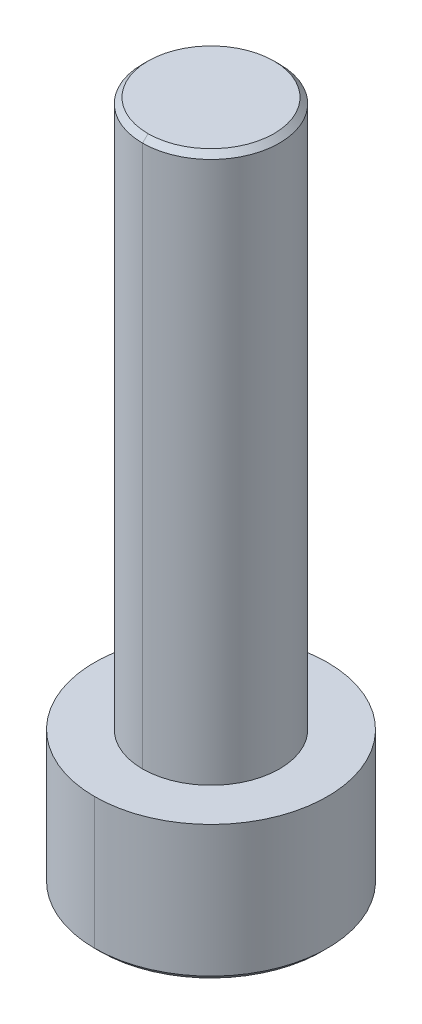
ISO-10303-21;
HEADER;
FILE_DESCRIPTION(('STEP AP214'),'2;1');
FILE_NAME('part.step','',(''),(''),'','','');
FILE_SCHEMA(('AUTOMOTIVE_DESIGN { 1 0 10303 214 1 1 1 1 }'));
ENDSEC;
DATA;
#1=APPLICATION_CONTEXT('core data for automotive mechanical design processes');
#2=APPLICATION_PROTOCOL_DEFINITION('international standard','automotive_design',2000,#1);
#3=PRODUCT_CONTEXT('',#1,'mechanical');
#4=PRODUCT('Part','Part','',(#3));
#5=PRODUCT_RELATED_PRODUCT_CATEGORY('part','',(#4));
#6=PRODUCT_DEFINITION_FORMATION('','',#4);
#7=PRODUCT_DEFINITION_CONTEXT('part definition',#1,'design');
#8=PRODUCT_DEFINITION('design','',#6,#7);
#9=PRODUCT_DEFINITION_SHAPE('','',#8);
#10=(LENGTH_UNIT() NAMED_UNIT(*) SI_UNIT(.MILLI.,.METRE.));
#11=(NAMED_UNIT(*) PLANE_ANGLE_UNIT() SI_UNIT($,.RADIAN.));
#12=(NAMED_UNIT(*) SI_UNIT($,.STERADIAN.) SOLID_ANGLE_UNIT());
#13=UNCERTAINTY_MEASURE_WITH_UNIT(LENGTH_MEASURE(1.E-05),#10,'distance_accuracy_value','');
#14=(GEOMETRIC_REPRESENTATION_CONTEXT(3) GLOBAL_UNCERTAINTY_ASSIGNED_CONTEXT((#13)) GLOBAL_UNIT_ASSIGNED_CONTEXT((#10,
#11,#12)) REPRESENTATION_CONTEXT('',''));
#15=CARTESIAN_POINT('',(0.,0.,0.));
#16=DIRECTION('',(0.,0.,1.));
#17=DIRECTION('',(1.,0.,0.));
#18=AXIS2_PLACEMENT_3D('',#15,#16,#17);
#19=CARTESIAN_POINT('',(-17.32050807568,-90.8165,-10.));
#20=DIRECTION('',(0.,-1.,0.));
#21=DIRECTION('',(-1.,0.,0.));
#22=AXIS2_PLACEMENT_3D('',#19,#20,#21);
#23=PLANE('',#22);
#24=DIRECTION('',(-0.50000000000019,0.,-0.866025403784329));
#25=VECTOR('',#24,1.);
#26=CARTESIAN_POINT('',(-16.16580753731,-90.8165,-12.));
#27=LINE('',#26,#25);
#28=CARTESIAN_POINT('',(-15.01110699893,-90.8165,-10.));
#29=VERTEX_POINT('',#28);
#30=CARTESIAN_POINT('',(-16.16580753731,-90.8165,-12.));
#31=VERTEX_POINT('',#30);
#32=EDGE_CURVE('E198',#29,#31,#27,.T.);
#33=ORIENTED_EDGE('',*,*,#32,.F.);
#34=DIRECTION('',(0.50000000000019,0.,-0.866025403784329));
#35=VECTOR('',#34,1.);
#36=CARTESIAN_POINT('',(-15.01110699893,-90.8165,-10.));
#37=LINE('',#36,#35);
#38=CARTESIAN_POINT('',(-16.16580753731,-90.8165,-8.));
#39=VERTEX_POINT('',#38);
#40=EDGE_CURVE('E10',#39,#29,#37,.T.);
#41=ORIENTED_EDGE('',*,*,#40,.F.);
#42=DIRECTION('',(1.,0.,0.));
#43=VECTOR('',#42,1.);
#44=CARTESIAN_POINT('',(-16.16580753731,-90.8165,-8.));
#45=LINE('',#44,#43);
#46=CARTESIAN_POINT('',(-18.47520861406,-90.8165,-8.));
#47=VERTEX_POINT('',#46);
#48=EDGE_CURVE('E46',#47,#39,#45,.T.);
#49=ORIENTED_EDGE('',*,*,#48,.F.);
#50=DIRECTION('',(0.50000000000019,0.,0.866025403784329));
#51=VECTOR('',#50,1.);
#52=CARTESIAN_POINT('',(-18.47520861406,-90.8165,-8.));
#53=LINE('',#52,#51);
#54=CARTESIAN_POINT('',(-19.62990915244,-90.8165,-10.));
#55=VERTEX_POINT('',#54);
#56=EDGE_CURVE('E192',#55,#47,#53,.T.);
#57=ORIENTED_EDGE('',*,*,#56,.F.);
#58=DIRECTION('',(-0.50000000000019,0.,0.866025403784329));
#59=VECTOR('',#58,1.);
#60=CARTESIAN_POINT('',(-19.62990915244,-90.8165,-10.));
#61=LINE('',#60,#59);
#62=CARTESIAN_POINT('',(-18.47520861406,-90.8165,-12.));
#63=VERTEX_POINT('',#62);
#64=EDGE_CURVE('E179',#63,#55,#61,.T.);
#65=ORIENTED_EDGE('',*,*,#64,.F.);
#66=DIRECTION('',(-1.,0.,0.));
#67=VECTOR('',#66,1.);
#68=CARTESIAN_POINT('',(-18.47520861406,-90.8165,-12.));
#69=LINE('',#68,#67);
#70=EDGE_CURVE('E20',#31,#63,#69,.T.);
#71=ORIENTED_EDGE('',*,*,#70,.F.);
#72=EDGE_LOOP('',(#33,#41,#49,#57,#65,#71));
#73=FACE_BOUND('',#72,.T.);
#74=ADVANCED_FACE('F16',(#73),#23,.T.);
#75=CARTESIAN_POINT('',(-15.01110699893,-90.8165,-10.));
#76=DIRECTION('',(-0.866025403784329,0.,-0.50000000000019));
#77=DIRECTION('',(-0.50000000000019,0.,0.866025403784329));
#78=AXIS2_PLACEMENT_3D('',#75,#76,#77);
#79=PLANE('',#78);
#80=DIRECTION('',(0.50000000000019,0.,-0.866025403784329));
#81=VECTOR('',#80,1.);
#82=CARTESIAN_POINT('',(-15.01110699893,-93.3165,-10.));
#83=LINE('',#82,#81);
#84=CARTESIAN_POINT('',(-16.16580753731,-93.3165,-8.));
#85=VERTEX_POINT('',#84);
#86=CARTESIAN_POINT('',(-15.01110699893,-93.3165,-10.));
#87=VERTEX_POINT('',#86);
#88=EDGE_CURVE('E215',#85,#87,#83,.T.);
#89=ORIENTED_EDGE('',*,*,#88,.F.);
#90=DIRECTION('',(0.,-1.,0.));
#91=VECTOR('',#90,1.);
#92=CARTESIAN_POINT('',(-16.16580753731,-90.8165,-8.));
#93=LINE('',#92,#91);
#94=EDGE_CURVE('E26',#39,#85,#93,.T.);
#95=ORIENTED_EDGE('',*,*,#94,.F.);
#96=ORIENTED_EDGE('',*,*,#40,.T.);
#97=DIRECTION('',(0.,-1.,0.));
#98=VECTOR('',#97,1.);
#99=CARTESIAN_POINT('',(-15.01110699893,-90.8165,-10.));
#100=LINE('',#99,#98);
#101=EDGE_CURVE('E154',#29,#87,#100,.T.);
#102=ORIENTED_EDGE('',*,*,#101,.T.);
#103=EDGE_LOOP('',(#89,#95,#96,#102));
#104=FACE_BOUND('',#103,.T.);
#105=ADVANCED_FACE('F342',(#104),#79,.T.);
#106=CARTESIAN_POINT('',(-16.16580753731,-90.8165,-8.));
#107=DIRECTION('',(0.,0.,-1.));
#108=DIRECTION('',(-1.,0.,0.));
#109=AXIS2_PLACEMENT_3D('',#106,#107,#108);
#110=PLANE('',#109);
#111=DIRECTION('',(1.,0.,0.));
#112=VECTOR('',#111,1.);
#113=CARTESIAN_POINT('',(-16.16580753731,-93.3165,-8.));
#114=LINE('',#113,#112);
#115=CARTESIAN_POINT('',(-18.47520861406,-93.3165,-8.));
#116=VERTEX_POINT('',#115);
#117=EDGE_CURVE('E237',#116,#85,#114,.T.);
#118=ORIENTED_EDGE('',*,*,#117,.F.);
#119=DIRECTION('',(0.,-1.,0.));
#120=VECTOR('',#119,1.);
#121=CARTESIAN_POINT('',(-18.47520861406,-90.8165,-8.));
#122=LINE('',#121,#120);
#123=EDGE_CURVE('E196',#47,#116,#122,.T.);
#124=ORIENTED_EDGE('',*,*,#123,.F.);
#125=ORIENTED_EDGE('',*,*,#48,.T.);
#126=ORIENTED_EDGE('',*,*,#94,.T.);
#127=EDGE_LOOP('',(#118,#124,#125,#126));
#128=FACE_BOUND('',#127,.T.);
#129=ADVANCED_FACE('F292',(#128),#110,.T.);
#130=CARTESIAN_POINT('',(-18.47520861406,-90.8165,-8.));
#131=DIRECTION('',(0.866025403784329,0.,-0.50000000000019));
#132=DIRECTION('',(0.,-1.,0.));
#133=AXIS2_PLACEMENT_3D('',#130,#131,#132);
#134=PLANE('',#133);
#135=DIRECTION('',(0.50000000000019,0.,0.866025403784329));
#136=VECTOR('',#135,1.);
#137=CARTESIAN_POINT('',(-18.47520861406,-93.3165,-8.));
#138=LINE('',#137,#136);
#139=CARTESIAN_POINT('',(-19.62990915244,-93.3165,-10.));
#140=VERTEX_POINT('',#139);
#141=EDGE_CURVE('E190',#140,#116,#138,.T.);
#142=ORIENTED_EDGE('',*,*,#141,.F.);
#143=DIRECTION('',(0.,-1.,0.));
#144=VECTOR('',#143,1.);
#145=CARTESIAN_POINT('',(-19.62990915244,-90.8165,-10.));
#146=LINE('',#145,#144);
#147=EDGE_CURVE('E197',#55,#140,#146,.T.);
#148=ORIENTED_EDGE('',*,*,#147,.F.);
#149=ORIENTED_EDGE('',*,*,#56,.T.);
#150=ORIENTED_EDGE('',*,*,#123,.T.);
#151=EDGE_LOOP('',(#142,#148,#149,#150));
#152=FACE_BOUND('',#151,.T.);
#153=ADVANCED_FACE('F296',(#152),#134,.T.);
#154=CARTESIAN_POINT('',(-19.62990915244,-90.8165,-10.));
#155=DIRECTION('',(0.866025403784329,0.,0.50000000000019));
#156=DIRECTION('',(0.,-1.,0.));
#157=AXIS2_PLACEMENT_3D('',#154,#155,#156);
#158=PLANE('',#157);
#159=DIRECTION('',(-0.50000000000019,0.,0.866025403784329));
#160=VECTOR('',#159,1.);
#161=CARTESIAN_POINT('',(-19.62990915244,-93.3165,-10.));
#162=LINE('',#161,#160);
#163=CARTESIAN_POINT('',(-18.47520861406,-93.3165,-12.));
#164=VERTEX_POINT('',#163);
#165=EDGE_CURVE('E186',#164,#140,#162,.T.);
#166=ORIENTED_EDGE('',*,*,#165,.F.);
#167=DIRECTION('',(0.,-1.,0.));
#168=VECTOR('',#167,1.);
#169=CARTESIAN_POINT('',(-18.47520861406,-90.8165,-12.));
#170=LINE('',#169,#168);
#171=EDGE_CURVE('E177',#63,#164,#170,.T.);
#172=ORIENTED_EDGE('',*,*,#171,.F.);
#173=ORIENTED_EDGE('',*,*,#64,.T.);
#174=ORIENTED_EDGE('',*,*,#147,.T.);
#175=EDGE_LOOP('',(#166,#172,#173,#174));
#176=FACE_BOUND('',#175,.T.);
#177=ADVANCED_FACE('F18',(#176),#158,.T.);
#178=CARTESIAN_POINT('',(-18.47520861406,-90.8165,-12.));
#179=DIRECTION('',(0.,0.,1.));
#180=DIRECTION('',(1.,0.,0.));
#181=AXIS2_PLACEMENT_3D('',#178,#179,#180);
#182=PLANE('',#181);
#183=DIRECTION('',(-1.,0.,0.));
#184=VECTOR('',#183,1.);
#185=CARTESIAN_POINT('',(-18.47520861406,-93.3165,-12.));
#186=LINE('',#185,#184);
#187=CARTESIAN_POINT('',(-16.16580753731,-93.3165,-12.));
#188=VERTEX_POINT('',#187);
#189=EDGE_CURVE('E191',#188,#164,#186,.T.);
#190=ORIENTED_EDGE('',*,*,#189,.F.);
#191=DIRECTION('',(0.,-1.,0.));
#192=VECTOR('',#191,1.);
#193=CARTESIAN_POINT('',(-16.16580753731,-90.8165,-12.));
#194=LINE('',#193,#192);
#195=EDGE_CURVE('E201',#31,#188,#194,.T.);
#196=ORIENTED_EDGE('',*,*,#195,.F.);
#197=ORIENTED_EDGE('',*,*,#70,.T.);
#198=ORIENTED_EDGE('',*,*,#171,.T.);
#199=EDGE_LOOP('',(#190,#196,#197,#198));
#200=FACE_BOUND('',#199,.T.);
#201=ADVANCED_FACE('F301',(#200),#182,.T.);
#202=CARTESIAN_POINT('',(-16.16580753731,-90.8165,-12.));
#203=DIRECTION('',(-0.866025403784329,0.,0.50000000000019));
#204=DIRECTION('',(0.,1.,0.));
#205=AXIS2_PLACEMENT_3D('',#202,#203,#204);
#206=PLANE('',#205);
#207=DIRECTION('',(-0.50000000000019,0.,-0.866025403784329));
#208=VECTOR('',#207,1.);
#209=CARTESIAN_POINT('',(-16.16580753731,-93.3165,-12.));
#210=LINE('',#209,#208);
#211=EDGE_CURVE('E233',#87,#188,#210,.T.);
#212=ORIENTED_EDGE('',*,*,#211,.F.);
#213=ORIENTED_EDGE('',*,*,#101,.F.);
#214=ORIENTED_EDGE('',*,*,#32,.T.);
#215=ORIENTED_EDGE('',*,*,#195,.T.);
#216=EDGE_LOOP('',(#212,#213,#214,#215));
#217=FACE_BOUND('',#216,.T.);
#218=ADVANCED_FACE('F357',(#217),#206,.T.);
#219=CARTESIAN_POINT('',(-15.02050807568,-68.3165,-10.));
#220=DIRECTION('',(0.,1.,0.));
#221=DIRECTION('',(0.,0.,-1.));
#222=AXIS2_PLACEMENT_3D('',#219,#220,#221);
#223=PLANE('',#222);
#224=CARTESIAN_POINT('',(-17.32050807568,-68.3165,-10.));
#225=DIRECTION('',(0.,-1.,0.));
#226=DIRECTION('',(0.,0.,-1.));
#227=AXIS2_PLACEMENT_3D('',#224,#225,#226);
#228=CIRCLE('',#227,2.3);
#229=CARTESIAN_POINT('',(-17.32050807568,-68.3165,-12.3));
#230=VERTEX_POINT('',#229);
#231=CARTESIAN_POINT('',(-17.32050807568,-68.3165,-7.7));
#232=VERTEX_POINT('',#231);
#233=EDGE_CURVE('E149',#230,#232,#228,.T.);
#234=ORIENTED_EDGE('',*,*,#233,.F.);
#235=CARTESIAN_POINT('',(-17.32050807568,-68.3165,-10.));
#236=DIRECTION('',(0.,-1.,0.));
#237=DIRECTION('',(0.,0.,-1.));
#238=AXIS2_PLACEMENT_3D('',#235,#236,#237);
#239=CIRCLE('',#238,2.3);
#240=EDGE_CURVE('E145',#232,#230,#239,.T.);
#241=ORIENTED_EDGE('',*,*,#240,.F.);
#242=EDGE_LOOP('',(#234,#241));
#243=FACE_BOUND('',#242,.T.);
#244=ADVANCED_FACE('F147',(#243),#223,.T.);
#245=CARTESIAN_POINT('',(-17.32050807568,-68.5165,-10.));
#246=DIRECTION('',(0.,-1.,0.));
#247=DIRECTION('',(0.,0.,-1.));
#248=AXIS2_PLACEMENT_3D('',#245,#246,#247);
#249=CONICAL_SURFACE('',#248,2.5,0.785398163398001);
#250=DIRECTION('',(0.,-0.707106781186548,0.707106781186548));
#251=VECTOR('',#250,1.);
#252=CARTESIAN_POINT('',(-17.32050807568,-68.5165,-7.5));
#253=LINE('',#252,#251);
#254=CARTESIAN_POINT('',(-17.32050807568,-68.5165,-7.5));
#255=VERTEX_POINT('',#254);
#256=EDGE_CURVE('E158',#232,#255,#253,.T.);
#257=ORIENTED_EDGE('',*,*,#256,.F.);
#258=ORIENTED_EDGE('',*,*,#240,.T.);
#259=DIRECTION('',(0.,-0.707106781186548,-0.707106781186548));
#260=VECTOR('',#259,1.);
#261=CARTESIAN_POINT('',(-17.32050807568,-68.5165,-12.5));
#262=LINE('',#261,#260);
#263=CARTESIAN_POINT('',(-17.32050807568,-68.5165,-12.5));
#264=VERTEX_POINT('',#263);
#265=EDGE_CURVE('E167',#230,#264,#262,.T.);
#266=ORIENTED_EDGE('',*,*,#265,.T.);
#267=CARTESIAN_POINT('',(-17.32050807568,-68.5165,-10.));
#268=DIRECTION('',(0.,-1.,0.));
#269=DIRECTION('',(0.,0.,-1.));
#270=AXIS2_PLACEMENT_3D('',#267,#268,#269);
#271=CIRCLE('',#270,2.5);
#272=EDGE_CURVE('E155',#255,#264,#271,.T.);
#273=ORIENTED_EDGE('',*,*,#272,.F.);
#274=EDGE_LOOP('',(#257,#258,#266,#273));
#275=FACE_BOUND('',#274,.T.);
#276=ADVANCED_FACE('F159',(#275),#249,.T.);
#277=CARTESIAN_POINT('',(-17.32050807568,-588.3165,-10.));
#278=DIRECTION('',(0.,-1.,0.));
#279=DIRECTION('',(0.,0.,-1.));
#280=AXIS2_PLACEMENT_3D('',#277,#278,#279);
#281=CYLINDRICAL_SURFACE('',#280,2.5);
#282=DIRECTION('',(0.,-1.,0.));
#283=VECTOR('',#282,1.);
#284=CARTESIAN_POINT('',(-17.32050807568,-588.3165,-7.5));
#285=LINE('',#284,#283);
#286=CARTESIAN_POINT('',(-17.32050807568,-88.3165,-7.5));
#287=VERTEX_POINT('',#286);
#288=EDGE_CURVE('E220',#255,#287,#285,.T.);
#289=ORIENTED_EDGE('',*,*,#288,.F.);
#290=ORIENTED_EDGE('',*,*,#272,.T.);
#291=DIRECTION('',(0.,-1.,0.));
#292=VECTOR('',#291,1.);
#293=CARTESIAN_POINT('',(-17.32050807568,-588.3165,-12.5));
#294=LINE('',#293,#292);
#295=CARTESIAN_POINT('',(-17.32050807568,-88.3165,-12.5));
#296=VERTEX_POINT('',#295);
#297=EDGE_CURVE('E208',#264,#296,#294,.T.);
#298=ORIENTED_EDGE('',*,*,#297,.T.);
#299=CARTESIAN_POINT('',(-17.32050807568,-88.3165,-10.));
#300=DIRECTION('',(0.,-1.,0.));
#301=DIRECTION('',(0.,0.,-1.));
#302=AXIS2_PLACEMENT_3D('',#299,#300,#301);
#303=CIRCLE('',#302,2.5);
#304=EDGE_CURVE('E240',#287,#296,#303,.T.);
#305=ORIENTED_EDGE('',*,*,#304,.F.);
#306=EDGE_LOOP('',(#289,#290,#298,#305));
#307=FACE_BOUND('',#306,.T.);
#308=ADVANCED_FACE('F325',(#307),#281,.T.);
#309=CARTESIAN_POINT('',(-13.07050807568,-88.3165,-10.));
#310=DIRECTION('',(0.,1.,0.));
#311=DIRECTION('',(0.,0.,-1.));
#312=AXIS2_PLACEMENT_3D('',#309,#310,#311);
#313=PLANE('',#312);
#314=CARTESIAN_POINT('',(-17.32050807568,-88.3165,-10.));
#315=DIRECTION('',(0.,-1.,0.));
#316=DIRECTION('',(0.,0.,-1.));
#317=AXIS2_PLACEMENT_3D('',#314,#315,#316);
#318=CIRCLE('',#317,4.25);
#319=CARTESIAN_POINT('',(-17.32050807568,-88.3165,-14.25));
#320=VERTEX_POINT('',#319);
#321=CARTESIAN_POINT('',(-17.32050807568,-88.3165,-5.75));
#322=VERTEX_POINT('',#321);
#323=EDGE_CURVE('E203',#320,#322,#318,.T.);
#324=ORIENTED_EDGE('',*,*,#323,.F.);
#325=CARTESIAN_POINT('',(-17.32050807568,-88.3165,-10.));
#326=DIRECTION('',(0.,-1.,0.));
#327=DIRECTION('',(0.,0.,-1.));
#328=AXIS2_PLACEMENT_3D('',#325,#326,#327);
#329=CIRCLE('',#328,4.25);
#330=EDGE_CURVE('E264',#322,#320,#329,.T.);
#331=ORIENTED_EDGE('',*,*,#330,.F.);
#332=EDGE_LOOP('',(#324,#331));
#333=FACE_BOUND('',#332,.T.);
#334=CARTESIAN_POINT('',(-17.32050807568,-88.3165,-10.));
#335=DIRECTION('',(0.,-1.,0.));
#336=DIRECTION('',(0.,0.,-1.));
#337=AXIS2_PLACEMENT_3D('',#334,#335,#336);
#338=CIRCLE('',#337,2.5);
#339=EDGE_CURVE('E175',#296,#287,#338,.T.);
#340=ORIENTED_EDGE('',*,*,#339,.T.);
#341=ORIENTED_EDGE('',*,*,#304,.T.);
#342=EDGE_LOOP('',(#340,#341));
#343=FACE_BOUND('',#342,.T.);
#344=ADVANCED_FACE('F312',(#333,#343),#313,.T.);
#345=CARTESIAN_POINT('',(-17.32050807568,-588.3165,-10.));
#346=DIRECTION('',(0.,-1.,0.));
#347=DIRECTION('',(0.,0.,-1.));
#348=AXIS2_PLACEMENT_3D('',#345,#346,#347);
#349=CYLINDRICAL_SURFACE('',#348,4.25);
#350=DIRECTION('',(0.,-1.,0.));
#351=VECTOR('',#350,1.);
#352=CARTESIAN_POINT('',(-17.32050807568,-588.3165,-5.75));
#353=LINE('',#352,#351);
#354=CARTESIAN_POINT('',(-17.32050807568,-93.1165,-5.75));
#355=VERTEX_POINT('',#354);
#356=EDGE_CURVE('E207',#322,#355,#353,.T.);
#357=ORIENTED_EDGE('',*,*,#356,.F.);
#358=ORIENTED_EDGE('',*,*,#330,.T.);
#359=DIRECTION('',(0.,-1.,0.));
#360=VECTOR('',#359,1.);
#361=CARTESIAN_POINT('',(-17.32050807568,-588.3165,-14.25));
#362=LINE('',#361,#360);
#363=CARTESIAN_POINT('',(-17.32050807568,-93.1165,-14.25));
#364=VERTEX_POINT('',#363);
#365=EDGE_CURVE('E180',#320,#364,#362,.T.);
#366=ORIENTED_EDGE('',*,*,#365,.T.);
#367=CARTESIAN_POINT('',(-17.32050807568,-93.1165,-10.));
#368=DIRECTION('',(0.,-1.,0.));
#369=DIRECTION('',(0.,0.,-1.));
#370=AXIS2_PLACEMENT_3D('',#367,#368,#369);
#371=CIRCLE('',#370,4.25);
#372=EDGE_CURVE('E262',#355,#364,#371,.T.);
#373=ORIENTED_EDGE('',*,*,#372,.F.);
#374=EDGE_LOOP('',(#357,#358,#366,#373));
#375=FACE_BOUND('',#374,.T.);
#376=ADVANCED_FACE('F306',(#375),#349,.T.);
#377=CARTESIAN_POINT('',(-17.32050807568,-93.3165,-10.));
#378=DIRECTION('',(0.,1.,0.));
#379=DIRECTION('',(0.,0.,1.));
#380=AXIS2_PLACEMENT_3D('',#377,#378,#379);
#381=CONICAL_SURFACE('',#380,4.05,0.785398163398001);
#382=DIRECTION('',(0.,0.707106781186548,-0.707106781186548));
#383=VECTOR('',#382,1.);
#384=CARTESIAN_POINT('',(-17.32050807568,-93.3165,-14.05));
#385=LINE('',#384,#383);
#386=CARTESIAN_POINT('',(-17.32050807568,-93.3165,-14.05));
#387=VERTEX_POINT('',#386);
#388=EDGE_CURVE('E226',#387,#364,#385,.T.);
#389=ORIENTED_EDGE('',*,*,#388,.F.);
#390=CARTESIAN_POINT('',(-17.32050807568,-93.3165,-10.));
#391=DIRECTION('',(0.,-1.,0.));
#392=DIRECTION('',(0.,0.,-1.));
#393=AXIS2_PLACEMENT_3D('',#390,#391,#392);
#394=CIRCLE('',#393,4.05);
#395=CARTESIAN_POINT('',(-17.32050807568,-93.3165,-5.95));
#396=VERTEX_POINT('',#395);
#397=EDGE_CURVE('E62',#396,#387,#394,.T.);
#398=ORIENTED_EDGE('',*,*,#397,.F.);
#399=DIRECTION('',(0.,0.707106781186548,0.707106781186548));
#400=VECTOR('',#399,1.);
#401=CARTESIAN_POINT('',(-17.32050807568,-93.3165,-5.95));
#402=LINE('',#401,#400);
#403=EDGE_CURVE('E216',#396,#355,#402,.T.);
#404=ORIENTED_EDGE('',*,*,#403,.T.);
#405=ORIENTED_EDGE('',*,*,#372,.T.);
#406=EDGE_LOOP('',(#389,#398,#404,#405));
#407=FACE_BOUND('',#406,.T.);
#408=ADVANCED_FACE('F311',(#407),#381,.T.);
#409=CARTESIAN_POINT('',(-17.32050807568,-93.3165,-10.));
#410=DIRECTION('',(0.,-1.,0.));
#411=DIRECTION('',(-1.,0.,0.));
#412=AXIS2_PLACEMENT_3D('',#409,#410,#411);
#413=PLANE('',#412);
#414=ORIENTED_EDGE('',*,*,#88,.T.);
#415=ORIENTED_EDGE('',*,*,#211,.T.);
#416=ORIENTED_EDGE('',*,*,#189,.T.);
#417=ORIENTED_EDGE('',*,*,#165,.T.);
#418=ORIENTED_EDGE('',*,*,#141,.T.);
#419=ORIENTED_EDGE('',*,*,#117,.T.);
#420=EDGE_LOOP('',(#414,#415,#416,#417,#418,#419));
#421=FACE_BOUND('',#420,.T.);
#422=ORIENTED_EDGE('',*,*,#397,.T.);
#423=CARTESIAN_POINT('',(-17.32050807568,-93.3165,-10.));
#424=DIRECTION('',(0.,-1.,0.));
#425=DIRECTION('',(0.,0.,-1.));
#426=AXIS2_PLACEMENT_3D('',#423,#424,#425);
#427=CIRCLE('',#426,4.05);
#428=EDGE_CURVE('E184',#387,#396,#427,.T.);
#429=ORIENTED_EDGE('',*,*,#428,.T.);
#430=EDGE_LOOP('',(#422,#429));
#431=FACE_BOUND('',#430,.T.);
#432=ADVANCED_FACE('F410',(#421,#431),#413,.T.);
#433=CARTESIAN_POINT('',(-17.32050807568,-93.3165,-10.));
#434=DIRECTION('',(0.,1.,0.));
#435=DIRECTION('',(0.,0.,1.));
#436=AXIS2_PLACEMENT_3D('',#433,#434,#435);
#437=CONICAL_SURFACE('',#436,4.05,0.785398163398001);
#438=ORIENTED_EDGE('',*,*,#428,.F.);
#439=ORIENTED_EDGE('',*,*,#388,.T.);
#440=CARTESIAN_POINT('',(-17.32050807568,-93.1165,-10.));
#441=DIRECTION('',(0.,-1.,0.));
#442=DIRECTION('',(0.,0.,-1.));
#443=AXIS2_PLACEMENT_3D('',#440,#441,#442);
#444=CIRCLE('',#443,4.25);
#445=EDGE_CURVE('E185',#364,#355,#444,.T.);
#446=ORIENTED_EDGE('',*,*,#445,.T.);
#447=ORIENTED_EDGE('',*,*,#403,.F.);
#448=EDGE_LOOP('',(#438,#439,#446,#447));
#449=FACE_BOUND('',#448,.T.);
#450=ADVANCED_FACE('F369',(#449),#437,.T.);
#451=CARTESIAN_POINT('',(-17.32050807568,-588.3165,-10.));
#452=DIRECTION('',(0.,-1.,0.));
#453=DIRECTION('',(0.,0.,-1.));
#454=AXIS2_PLACEMENT_3D('',#451,#452,#453);
#455=CYLINDRICAL_SURFACE('',#454,4.25);
#456=ORIENTED_EDGE('',*,*,#323,.T.);
#457=ORIENTED_EDGE('',*,*,#356,.T.);
#458=ORIENTED_EDGE('',*,*,#445,.F.);
#459=ORIENTED_EDGE('',*,*,#365,.F.);
#460=EDGE_LOOP('',(#456,#457,#458,#459));
#461=FACE_BOUND('',#460,.T.);
#462=ADVANCED_FACE('F364',(#461),#455,.T.);
#463=CARTESIAN_POINT('',(-17.32050807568,-588.3165,-10.));
#464=DIRECTION('',(0.,-1.,0.));
#465=DIRECTION('',(0.,0.,-1.));
#466=AXIS2_PLACEMENT_3D('',#463,#464,#465);
#467=CYLINDRICAL_SURFACE('',#466,2.5);
#468=CARTESIAN_POINT('',(-17.32050807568,-68.5165,-10.));
#469=DIRECTION('',(0.,-1.,0.));
#470=DIRECTION('',(0.,0.,-1.));
#471=AXIS2_PLACEMENT_3D('',#468,#469,#470);
#472=CIRCLE('',#471,2.5);
#473=EDGE_CURVE('E164',#264,#255,#472,.T.);
#474=ORIENTED_EDGE('',*,*,#473,.T.);
#475=ORIENTED_EDGE('',*,*,#288,.T.);
#476=ORIENTED_EDGE('',*,*,#339,.F.);
#477=ORIENTED_EDGE('',*,*,#297,.F.);
#478=EDGE_LOOP('',(#474,#475,#476,#477));
#479=FACE_BOUND('',#478,.T.);
#480=ADVANCED_FACE('F336',(#479),#467,.T.);
#481=CARTESIAN_POINT('',(-17.32050807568,-68.5165,-10.));
#482=DIRECTION('',(0.,-1.,0.));
#483=DIRECTION('',(0.,0.,-1.));
#484=AXIS2_PLACEMENT_3D('',#481,#482,#483);
#485=CONICAL_SURFACE('',#484,2.5,0.785398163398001);
#486=ORIENTED_EDGE('',*,*,#233,.T.);
#487=ORIENTED_EDGE('',*,*,#256,.T.);
#488=ORIENTED_EDGE('',*,*,#473,.F.);
#489=ORIENTED_EDGE('',*,*,#265,.F.);
#490=EDGE_LOOP('',(#486,#487,#488,#489));
#491=FACE_BOUND('',#490,.T.);
#492=ADVANCED_FACE('F166',(#491),#485,.T.);
#493=CLOSED_SHELL('',(#74,#105,#129,#153,#177,#201,#218,#244,#276,#308,#344,#376,#408,#432,#450,
#462,#480,#492));
#494=MANIFOLD_SOLID_BREP('B1',#493);
#495=ADVANCED_BREP_SHAPE_REPRESENTATION('',(#18,#494),#14);
#496=SHAPE_DEFINITION_REPRESENTATION(#9,#495);
ENDSEC;
END-ISO-10303-21;
